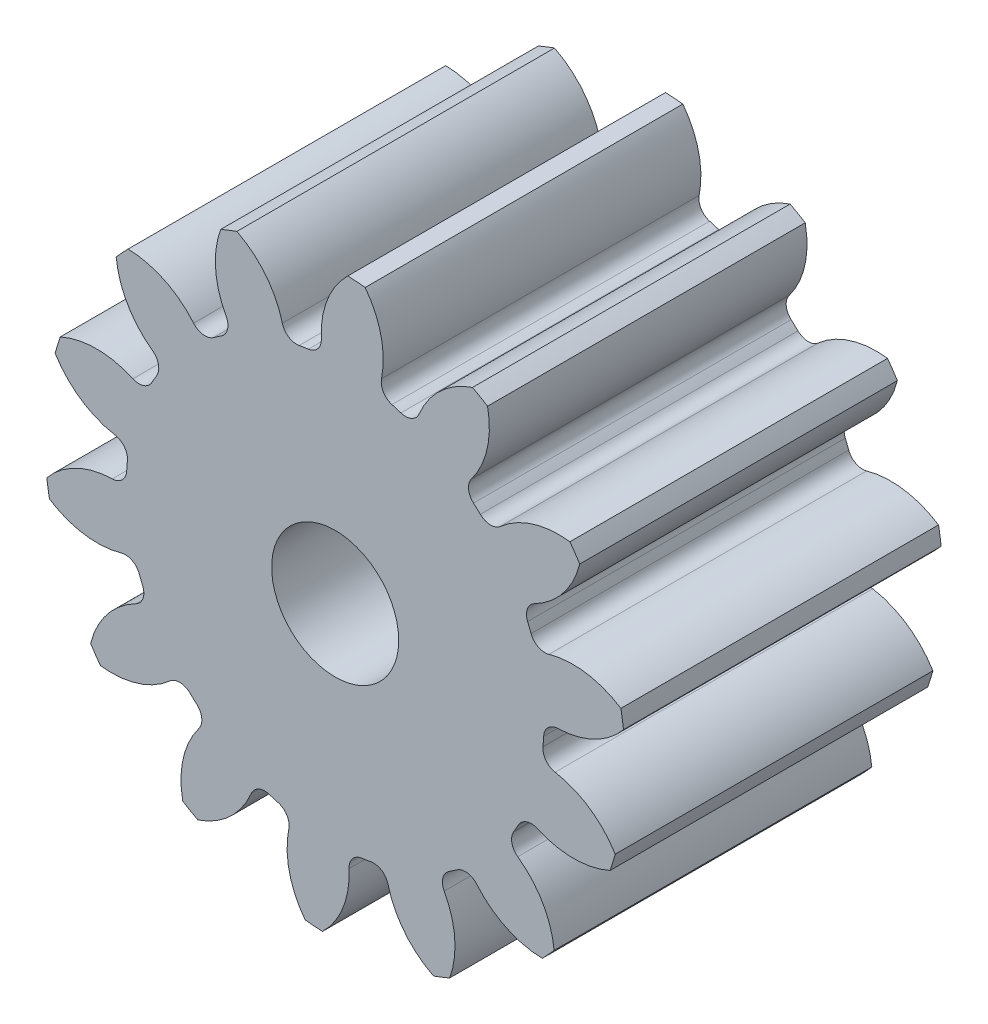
from build123d import *

# Parameters (mm, degrees)
SKETCH3_R         = 81.28
GEARBODY_DEPTH    = 88.9
TOOTHCUT_DEPTH    = 146.313752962
CIRPATTERN1_COUNT = 14
BOREDIA_R         = 17.78
BORE_DEPTH        = 12700


with BuildPart() as part:
    # Sketch3 → gearBody (new body)
    with BuildSketch(Plane.XY):
        Circle(SKETCH3_R)
    extrude(amount=GEARBODY_DEPTH)

    # Sketch2 → toothCut (cut, through all)
    with BuildSketch(Plane.XY):
        with BuildLine():
            ThreePointArc((58.151751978, -5.591971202), (58.26208467, -4.292538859), (58.343384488, -2.990967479))
            ThreePointArc((58.343384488, -2.990967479), (59.587192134, -0.24111213), (62.368314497, 0.931116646))
            ThreePointArc((62.368314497, 0.931116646), (72.910570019, 3.59743374), (81.28, 10.540130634))
            ThreePointArc((81.28, 10.540130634), (81.739008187, -6.022233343), (78.857622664, -22.338489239))
            ThreePointArc((78.857622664, -22.338489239), (71.596066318, -14.244158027), (61.558411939, -10.061587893))
            ThreePointArc((61.558411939, -10.061587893), (58.979118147, -8.494423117), (58.151751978, -5.591971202))
        make_face()
    toothcut = extrude(amount=TOOTHCUT_DEPTH, mode=Mode.SUBTRACT)

    # CirPattern1: toothCut ×14 about axis
    cirpattern1_axis = Axis((0, 0, 0), (0, 0, 1))
    for i in range(1, CIRPATTERN1_COUNT):
        add(toothcut.rotate(cirpattern1_axis, i * 360 / CIRPATTERN1_COUNT), mode=Mode.SUBTRACT)

    # boreDia → bore (cut, symmetric)
    with BuildSketch(Plane.XY):
        Circle(BOREDIA_R)
    extrude(amount=BORE_DEPTH, both=True, mode=Mode.SUBTRACT)


solid = part.part
